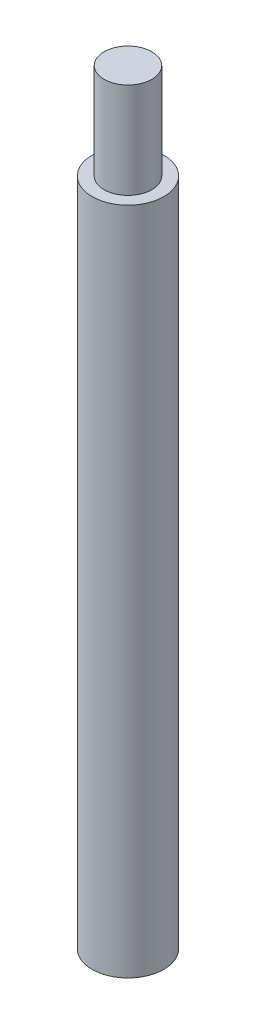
ISO-10303-21;
HEADER;
FILE_DESCRIPTION(('STEP AP214'),'2;1');
FILE_NAME('part.step','',(''),(''),'','','');
FILE_SCHEMA(('AUTOMOTIVE_DESIGN { 1 0 10303 214 1 1 1 1 }'));
ENDSEC;
DATA;
#1=APPLICATION_CONTEXT('core data for automotive mechanical design processes');
#2=APPLICATION_PROTOCOL_DEFINITION('international standard','automotive_design',2000,#1);
#3=PRODUCT_CONTEXT('',#1,'mechanical');
#4=PRODUCT('Part','Part','',(#3));
#5=PRODUCT_RELATED_PRODUCT_CATEGORY('part','',(#4));
#6=PRODUCT_DEFINITION_FORMATION('','',#4);
#7=PRODUCT_DEFINITION_CONTEXT('part definition',#1,'design');
#8=PRODUCT_DEFINITION('design','',#6,#7);
#9=PRODUCT_DEFINITION_SHAPE('','',#8);
#10=(LENGTH_UNIT() NAMED_UNIT(*) SI_UNIT(.MILLI.,.METRE.));
#11=(NAMED_UNIT(*) PLANE_ANGLE_UNIT() SI_UNIT($,.RADIAN.));
#12=(NAMED_UNIT(*) SI_UNIT($,.STERADIAN.) SOLID_ANGLE_UNIT());
#13=UNCERTAINTY_MEASURE_WITH_UNIT(LENGTH_MEASURE(1.E-05),#10,'distance_accuracy_value','');
#14=(GEOMETRIC_REPRESENTATION_CONTEXT(3) GLOBAL_UNCERTAINTY_ASSIGNED_CONTEXT((#13)) GLOBAL_UNIT_ASSIGNED_CONTEXT((#10,
#11,#12)) REPRESENTATION_CONTEXT('',''));
#15=CARTESIAN_POINT('',(0.,0.,0.));
#16=DIRECTION('',(0.,0.,1.));
#17=DIRECTION('',(1.,0.,0.));
#18=AXIS2_PLACEMENT_3D('',#15,#16,#17);
#19=CARTESIAN_POINT('',(0.,140.,0.));
#20=DIRECTION('',(0.,-1.,0.));
#21=DIRECTION('',(0.,0.,-1.));
#22=AXIS2_PLACEMENT_3D('',#19,#20,#21);
#23=CYLINDRICAL_SURFACE('',#22,5.);
#24=CARTESIAN_POINT('',(0.,0.,0.));
#25=DIRECTION('',(0.,1.,0.));
#26=DIRECTION('',(0.,0.,1.));
#27=AXIS2_PLACEMENT_3D('',#24,#25,#26);
#28=CIRCLE('',#27,5.);
#29=CARTESIAN_POINT('',(0.,0.,5.));
#30=VERTEX_POINT('',#29);
#31=EDGE_CURVE('E64',#30,#30,#28,.T.);
#32=ORIENTED_EDGE('',*,*,#31,.F.);
#33=EDGE_LOOP('',(#32));
#34=FACE_BOUND('',#33,.T.);
#35=CARTESIAN_POINT('',(0.,10.,0.));
#36=DIRECTION('',(0.,1.,0.));
#37=DIRECTION('',(0.,0.,1.));
#38=AXIS2_PLACEMENT_3D('',#35,#36,#37);
#39=CIRCLE('',#38,5.);
#40=CARTESIAN_POINT('',(0.,10.,5.));
#41=VERTEX_POINT('',#40);
#42=EDGE_CURVE('E72',#41,#41,#39,.T.);
#43=ORIENTED_EDGE('',*,*,#42,.T.);
#44=EDGE_LOOP('',(#43));
#45=FACE_BOUND('',#44,.T.);
#46=ADVANCED_FACE('F47',(#34,#45),#23,.F.);
#47=CARTESIAN_POINT('',(0.,140.,0.));
#48=DIRECTION('',(0.,1.,0.));
#49=DIRECTION('',(0.,0.,1.));
#50=AXIS2_PLACEMENT_3D('',#47,#48,#49);
#51=PLANE('',#50);
#52=CARTESIAN_POINT('',(0.,140.,0.));
#53=DIRECTION('',(0.,1.,0.));
#54=DIRECTION('',(0.,0.,1.));
#55=AXIS2_PLACEMENT_3D('',#52,#53,#54);
#56=CIRCLE('',#55,7.5);
#57=CARTESIAN_POINT('',(0.,140.,7.5));
#58=VERTEX_POINT('',#57);
#59=EDGE_CURVE('E10',#58,#58,#56,.T.);
#60=ORIENTED_EDGE('',*,*,#59,.T.);
#61=EDGE_LOOP('',(#60));
#62=FACE_BOUND('',#61,.T.);
#63=CARTESIAN_POINT('',(0.,140.,0.));
#64=DIRECTION('',(0.,1.,0.));
#65=DIRECTION('',(0.,0.,1.));
#66=AXIS2_PLACEMENT_3D('',#63,#64,#65);
#67=CIRCLE('',#66,5.);
#68=CARTESIAN_POINT('',(0.,140.,5.));
#69=VERTEX_POINT('',#68);
#70=EDGE_CURVE('E62',#69,#69,#67,.T.);
#71=ORIENTED_EDGE('',*,*,#70,.F.);
#72=EDGE_LOOP('',(#71));
#73=FACE_BOUND('',#72,.T.);
#74=ADVANCED_FACE('F96',(#62,#73),#51,.T.);
#75=CARTESIAN_POINT('',(0.,0.,0.));
#76=DIRECTION('',(0.,1.,0.));
#77=DIRECTION('',(0.,0.,1.));
#78=AXIS2_PLACEMENT_3D('',#75,#76,#77);
#79=PLANE('',#78);
#80=CARTESIAN_POINT('',(0.,0.,0.));
#81=DIRECTION('',(0.,1.,0.));
#82=DIRECTION('',(0.,0.,1.));
#83=AXIS2_PLACEMENT_3D('',#80,#81,#82);
#84=CIRCLE('',#83,7.5);
#85=CARTESIAN_POINT('',(0.,0.,7.5));
#86=VERTEX_POINT('',#85);
#87=EDGE_CURVE('E51',#86,#86,#84,.T.);
#88=ORIENTED_EDGE('',*,*,#87,.F.);
#89=EDGE_LOOP('',(#88));
#90=FACE_BOUND('',#89,.T.);
#91=ORIENTED_EDGE('',*,*,#31,.T.);
#92=EDGE_LOOP('',(#91));
#93=FACE_BOUND('',#92,.T.);
#94=ADVANCED_FACE('F101',(#90,#93),#79,.F.);
#95=CARTESIAN_POINT('',(0.,140.,0.));
#96=DIRECTION('',(0.,-1.,0.));
#97=DIRECTION('',(0.,0.,-1.));
#98=AXIS2_PLACEMENT_3D('',#95,#96,#97);
#99=CYLINDRICAL_SURFACE('',#98,7.5);
#100=ORIENTED_EDGE('',*,*,#59,.F.);
#101=EDGE_LOOP('',(#100));
#102=FACE_BOUND('',#101,.T.);
#103=ORIENTED_EDGE('',*,*,#87,.T.);
#104=EDGE_LOOP('',(#103));
#105=FACE_BOUND('',#104,.T.);
#106=ADVANCED_FACE('F49',(#102,#105),#99,.T.);
#107=CARTESIAN_POINT('',(0.,10.,0.));
#108=DIRECTION('',(0.,1.,0.));
#109=DIRECTION('',(0.,0.,1.));
#110=AXIS2_PLACEMENT_3D('',#107,#108,#109);
#111=PLANE('',#110);
#112=ORIENTED_EDGE('',*,*,#42,.F.);
#113=EDGE_LOOP('',(#112));
#114=FACE_BOUND('',#113,.T.);
#115=ADVANCED_FACE('F84',(#114),#111,.F.);
#116=CARTESIAN_POINT('',(0.,160.,0.));
#117=DIRECTION('',(0.,-1.,0.));
#118=DIRECTION('',(0.,0.,-1.));
#119=AXIS2_PLACEMENT_3D('',#116,#117,#118);
#120=CYLINDRICAL_SURFACE('',#119,5.);
#121=ORIENTED_EDGE('',*,*,#70,.T.);
#122=EDGE_LOOP('',(#121));
#123=FACE_BOUND('',#122,.T.);
#124=CARTESIAN_POINT('',(0.,160.,0.));
#125=DIRECTION('',(0.,1.,0.));
#126=DIRECTION('',(0.,0.,1.));
#127=AXIS2_PLACEMENT_3D('',#124,#125,#126);
#128=CIRCLE('',#127,5.);
#129=CARTESIAN_POINT('',(0.,160.,5.));
#130=VERTEX_POINT('',#129);
#131=EDGE_CURVE('E68',#130,#130,#128,.T.);
#132=ORIENTED_EDGE('',*,*,#131,.F.);
#133=EDGE_LOOP('',(#132));
#134=FACE_BOUND('',#133,.T.);
#135=ADVANCED_FACE('F82',(#123,#134),#120,.T.);
#136=CARTESIAN_POINT('',(0.,160.,0.));
#137=DIRECTION('',(0.,1.,0.));
#138=DIRECTION('',(0.,0.,1.));
#139=AXIS2_PLACEMENT_3D('',#136,#137,#138);
#140=PLANE('',#139);
#141=ORIENTED_EDGE('',*,*,#131,.T.);
#142=EDGE_LOOP('',(#141));
#143=FACE_BOUND('',#142,.T.);
#144=ADVANCED_FACE('F80',(#143),#140,.T.);
#145=CLOSED_SHELL('',(#46,#74,#94,#106,#115,#135,#144));
#146=MANIFOLD_SOLID_BREP('B2',#145);
#147=ADVANCED_BREP_SHAPE_REPRESENTATION('',(#18,#146),#14);
#148=SHAPE_DEFINITION_REPRESENTATION(#9,#147);
ENDSEC;
END-ISO-10303-21;
